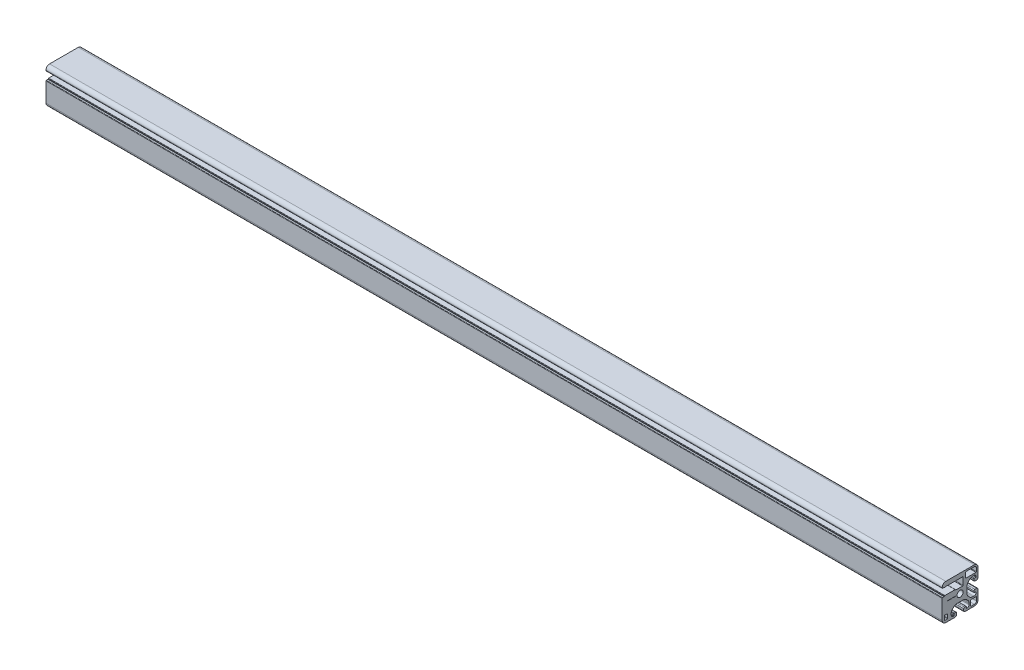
from build123d import *

# Parameters (mm, degrees)
MODEL_R                = 3.39490081
STRUKTURBAUTEIL1_DEPTH = 1000


with BuildPart() as part:
    # Model → Strukturbauteil1 (new body)
    with BuildSketch(Plane(origin=(0, 0, 0), x_dir=(0, 0, -1), z_dir=(1, 0, 0))):
        with BuildLine():
            Line((-19.970004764, 15.976003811), (-19.970004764, 15.476753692))
            ThreePointArc((-19.970004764, 15.476753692), (-19.82377779, 15.123730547), (-19.470754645, 14.977503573))
            Line((-19.470754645, 14.977503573), (-17.274054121, 14.977503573))
            ThreePointArc((-17.274054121, 14.977503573), (-16.974504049, 14.677953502), (-16.674953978, 14.977503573))
            Line((-16.674953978, 14.977503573), (-14.278553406, 14.977503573))
            ThreePointArc((-14.278553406, 14.977503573), (-13.979003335, 14.677953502), (-13.679453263, 14.977503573))
            Line((-13.679453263, 14.977503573), (-11.283052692, 14.977503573))
            ThreePointArc((-11.283052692, 14.977503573), (-10.98350262, 14.677953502), (-10.683952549, 14.977503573))
            Line((-10.683952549, 14.977503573), (-8.287551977, 14.977503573))
            ThreePointArc((-8.287551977, 14.977503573), (-7.988001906, 14.677953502), (-7.688451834, 14.977503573))
            Line((-7.688451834, 14.977503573), (-5.292051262, 14.977503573))
            ThreePointArc((-5.292051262, 14.977503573), (-4.992501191, 14.677953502), (-4.69295112, 14.977503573))
            Line((-4.69295112, 14.977503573), (2.795800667, 14.977503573))
            ThreePointArc((2.795800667, 14.977503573), (3.148823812, 14.831276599), (3.295050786, 14.478253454))
            Line((3.295050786, 14.478253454), (3.295050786, 6.490251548))
            ThreePointArc((3.295050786, 6.490251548), (3.148823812, 6.137228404), (2.795800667, 5.991001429))
            Line((2.795800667, 5.991001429), (-4.493251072, 5.991001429))
            ThreePointArc((-4.493251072, 5.991001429), (-4.846274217, 5.844774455), (-4.992501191, 5.49175131))
            Line((-4.992501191, 5.49175131), (-4.992501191, 0.499250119))
            ThreePointArc((-4.992501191, 0.499250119), (-5.138728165, 0.146226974), (-5.49175131, 0))
            Line((-5.49175131, 0), (-13.379903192, 0))
            ThreePointArc((-13.379903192, 0), (-13.732926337, -0.146226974), (-13.879153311, -0.499250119))
            Line((-13.879153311, -0.499250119), (-13.879153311, -11.460142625))
            Line((-13.879153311, -11.460142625), (-13.979003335, -11.460142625))
            Line((-13.979003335, -11.460142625), (-13.979003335, -0.050382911))
            ThreePointArc((-13.979003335, -0.050382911), (-13.89126715, 0.161430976), (-13.679453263, 0.249167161))
            Line((-13.679453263, 0.249167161), (-5.591601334, 0.249167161))
            ThreePointArc((-5.591601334, 0.249167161), (-5.379787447, 0.336903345), (-5.292051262, 0.548717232))
            Line((-5.292051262, 0.548717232), (-5.292051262, 6.439868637))
            ThreePointArc((-5.292051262, 6.439868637), (-5.379787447, 6.651682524), (-5.591601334, 6.739418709))
            Line((-5.591601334, 6.739418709), (-16.974504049, 6.739418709))
            ThreePointArc((-16.974504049, 6.739418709), (-17.186317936, 6.651682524), (-17.274054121, 6.439868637))
            Line((-17.274054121, 6.439868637), (-17.274054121, -11.460142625))
            Line((-17.274054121, -11.460142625), (-17.373904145, -11.460142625))
            Line((-17.373904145, -11.460142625), (-17.373904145, 5.49175131))
            ThreePointArc((-17.373904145, 5.49175131), (-17.520131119, 5.844774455), (-17.873154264, 5.991001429))
            Line((-17.873154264, 5.991001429), (-19.470754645, 5.991001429))
            ThreePointArc((-19.470754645, 5.991001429), (-19.82377779, 5.844774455), (-19.970004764, 5.49175131))
            Line((-19.970004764, 5.49175131), (-19.970004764, -15.976003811))
            ThreePointArc((-19.970004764, -15.976003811), (-18.800188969, -18.800188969), (-15.976003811, -19.970004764))
            Line((-15.976003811, -19.970004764), (-5.49175131, -19.970004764))
            ThreePointArc((-5.49175131, -19.970004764), (-4.432681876, -19.531323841), (-3.994000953, -18.472254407))
            Line((-3.994000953, -18.472254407), (-3.994000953, -16.47525393))
            ThreePointArc((-3.994000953, -16.47525393), (-4.286454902, -15.769207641), (-4.992501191, -15.476753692))
            Line((-4.992501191, -15.476753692), (-6.490251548, -15.476753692))
            ThreePointArc((-6.490251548, -15.476753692), (-6.843274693, -15.622980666), (-6.989501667, -15.976003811))
            Line((-6.989501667, -15.976003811), (-6.989501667, -17.473754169))
            ThreePointArc((-6.989501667, -17.473754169), (-7.135728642, -17.826777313), (-7.488751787, -17.973004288))
            ThreePointArc((-7.488751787, -17.973004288), (-9.25386751, -17.241869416), (-9.985002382, -15.476753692))
            Line((-9.985002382, -15.476753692), (-9.985002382, -14.171102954))
            ThreePointArc((-9.985002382, -14.171102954), (-9.604970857, -12.260555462), (-8.522732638, -10.640871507))
            Line((-8.522732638, -10.640871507), (-7.082507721, -9.20064659))
            ThreePointArc((-7.082507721, -9.20064659), (-5.462823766, -8.118408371), (-3.552276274, -7.738376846))
            Line((-3.552276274, -7.738376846), (3.552276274, -7.738376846))
            ThreePointArc((3.552276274, -7.738376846), (5.462823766, -8.118408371), (7.082507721, -9.20064659))
            Line((7.082507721, -9.20064659), (8.522732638, -10.640871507))
            ThreePointArc((8.522732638, -10.640871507), (9.604970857, -12.260555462), (9.985002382, -14.171102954))
            Line((9.985002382, -14.171102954), (9.985002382, -15.476753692))
            ThreePointArc((9.985002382, -15.476753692), (9.25386751, -17.241869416), (7.488751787, -17.973004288))
            ThreePointArc((7.488751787, -17.973004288), (7.135728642, -17.826777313), (6.989501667, -17.473754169))
            Line((6.989501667, -17.473754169), (6.989501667, -15.976003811))
            ThreePointArc((6.989501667, -15.976003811), (6.843274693, -15.622980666), (6.490251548, -15.476753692))
            Line((6.490251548, -15.476753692), (4.992501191, -15.476753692))
            ThreePointArc((4.992501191, -15.476753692), (4.286454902, -15.769207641), (3.994000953, -16.47525393))
            Line((3.994000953, -16.47525393), (3.994000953, -18.472254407))
            ThreePointArc((3.994000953, -18.472254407), (4.432681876, -19.531323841), (5.49175131, -19.970004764))
            Line((5.49175131, -19.970004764), (15.976003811, -19.970004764))
            ThreePointArc((15.976003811, -19.970004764), (18.800188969, -18.800188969), (19.970004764, -15.976003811))
            Line((19.970004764, -15.976003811), (19.970004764, -5.49175131))
            ThreePointArc((19.970004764, -5.49175131), (19.531323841, -4.432681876), (18.472254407, -3.994000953))
            Line((18.472254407, -3.994000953), (16.47525393, -3.994000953))
            ThreePointArc((16.47525393, -3.994000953), (15.769207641, -4.286454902), (15.476753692, -4.992501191))
            Line((15.476753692, -4.992501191), (15.476753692, -6.490251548))
            ThreePointArc((15.476753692, -6.490251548), (15.622980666, -6.843274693), (15.976003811, -6.989501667))
            Line((15.976003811, -6.989501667), (17.473754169, -6.989501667))
            ThreePointArc((17.473754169, -6.989501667), (17.826777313, -7.135728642), (17.973004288, -7.488751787))
            ThreePointArc((17.973004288, -7.488751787), (17.241869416, -9.25386751), (15.476753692, -9.985002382))
            Line((15.476753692, -9.985002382), (14.171102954, -9.985002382))
            ThreePointArc((14.171102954, -9.985002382), (12.260555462, -9.604970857), (10.640871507, -8.522732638))
            Line((10.640871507, -8.522732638), (9.20064659, -7.082507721))
            ThreePointArc((9.20064659, -7.082507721), (8.118408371, -5.462823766), (7.738376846, -3.552276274))
            Line((7.738376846, -3.552276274), (7.738376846, 3.552276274))
            ThreePointArc((7.738376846, 3.552276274), (8.118408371, 5.462823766), (9.20064659, 7.082507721))
            Line((9.20064659, 7.082507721), (10.640871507, 8.522732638))
            ThreePointArc((10.640871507, 8.522732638), (12.260555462, 9.604970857), (14.171102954, 9.985002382))
            Line((14.171102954, 9.985002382), (15.476753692, 9.985002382))
            ThreePointArc((15.476753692, 9.985002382), (17.241869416, 9.25386751), (17.973004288, 7.488751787))
            ThreePointArc((17.973004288, 7.488751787), (17.826777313, 7.135728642), (17.473754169, 6.989501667))
            Line((17.473754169, 6.989501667), (15.976003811, 6.989501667))
            ThreePointArc((15.976003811, 6.989501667), (15.622980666, 6.843274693), (15.476753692, 6.490251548))
            Line((15.476753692, 6.490251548), (15.476753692, 4.992501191))
            ThreePointArc((15.476753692, 4.992501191), (15.769207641, 4.286454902), (16.47525393, 3.994000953))
            Line((16.47525393, 3.994000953), (18.472254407, 3.994000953))
            ThreePointArc((18.472254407, 3.994000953), (19.531323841, 4.432681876), (19.970004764, 5.49175131))
            Line((19.970004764, 5.49175131), (19.970004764, 15.976003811))
            ThreePointArc((19.970004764, 15.976003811), (18.800188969, 18.800188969), (15.976003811, 19.970004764))
            Line((15.976003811, 19.970004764), (-15.976003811, 19.970004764))
            ThreePointArc((-15.976003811, 19.970004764), (-18.800188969, 18.800188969), (-19.970004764, 15.976003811))
        make_face()
        Circle(MODEL_R, mode=Mode.SUBTRACT)
        with BuildLine():
            Line((-17.373904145, -16.674953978), (-17.373904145, -11.932535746))
            Line((-17.373904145, -11.932535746), (-17.274054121, -11.932535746))
            ThreePointArc((-17.274054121, -11.932535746), (-17.186317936, -12.144349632), (-16.974504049, -12.232085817))
            Line((-16.974504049, -12.232085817), (-14.278553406, -12.232085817))
            ThreePointArc((-14.278553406, -12.232085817), (-14.066739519, -12.144349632), (-13.979003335, -11.932535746))
            Line((-13.979003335, -11.932535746), (-13.879153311, -11.932535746))
            Line((-13.879153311, -11.932535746), (-13.879153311, -16.674953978))
            ThreePointArc((-13.879153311, -16.674953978), (-14.025380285, -17.027977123), (-14.37840343, -17.174204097))
            Line((-14.37840343, -17.174204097), (-16.874654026, -17.174204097))
            ThreePointArc((-16.874654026, -17.174204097), (-17.22767717, -17.027977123), (-17.373904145, -16.674953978))
        make_face(mode=Mode.SUBTRACT)
        with BuildLine():
            Line((12.28155293, -18.172704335), (15.976003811, -18.172704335))
            ThreePointArc((15.976003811, -18.172704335), (17.529305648, -17.529305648), (18.172704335, -15.976003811))
            Line((18.172704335, -15.976003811), (18.172704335, -12.28155293))
            ThreePointArc((18.172704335, -12.28155293), (18.026477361, -11.928529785), (17.673454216, -11.782302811))
            Line((17.673454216, -11.782302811), (12.28155293, -11.782302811))
            ThreePointArc((12.28155293, -11.782302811), (11.928529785, -11.928529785), (11.782302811, -12.28155293))
            Line((11.782302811, -12.28155293), (11.782302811, -17.673454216))
            ThreePointArc((11.782302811, -17.673454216), (11.928529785, -18.026477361), (12.28155293, -18.172704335))
        make_face(mode=Mode.SUBTRACT)
        with BuildLine():
            Line((6.290551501, 17.673454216), (6.290551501, 12.28155293))
            ThreePointArc((6.290551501, 12.28155293), (6.436778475, 11.928529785), (6.78980162, 11.782302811))
            Line((6.78980162, 11.782302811), (17.673454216, 11.782302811))
            ThreePointArc((17.673454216, 11.782302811), (18.026477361, 11.928529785), (18.172704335, 12.28155293))
            Line((18.172704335, 12.28155293), (18.172704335, 15.976003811))
            ThreePointArc((18.172704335, 15.976003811), (17.529305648, 17.529305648), (15.976003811, 18.172704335))
            Line((15.976003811, 18.172704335), (6.78980162, 18.172704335))
            ThreePointArc((6.78980162, 18.172704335), (6.436778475, 18.026477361), (6.290551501, 17.673454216))
        make_face(mode=Mode.SUBTRACT)
    extrude(amount=STRUKTURBAUTEIL1_DEPTH)


solid = part.part
